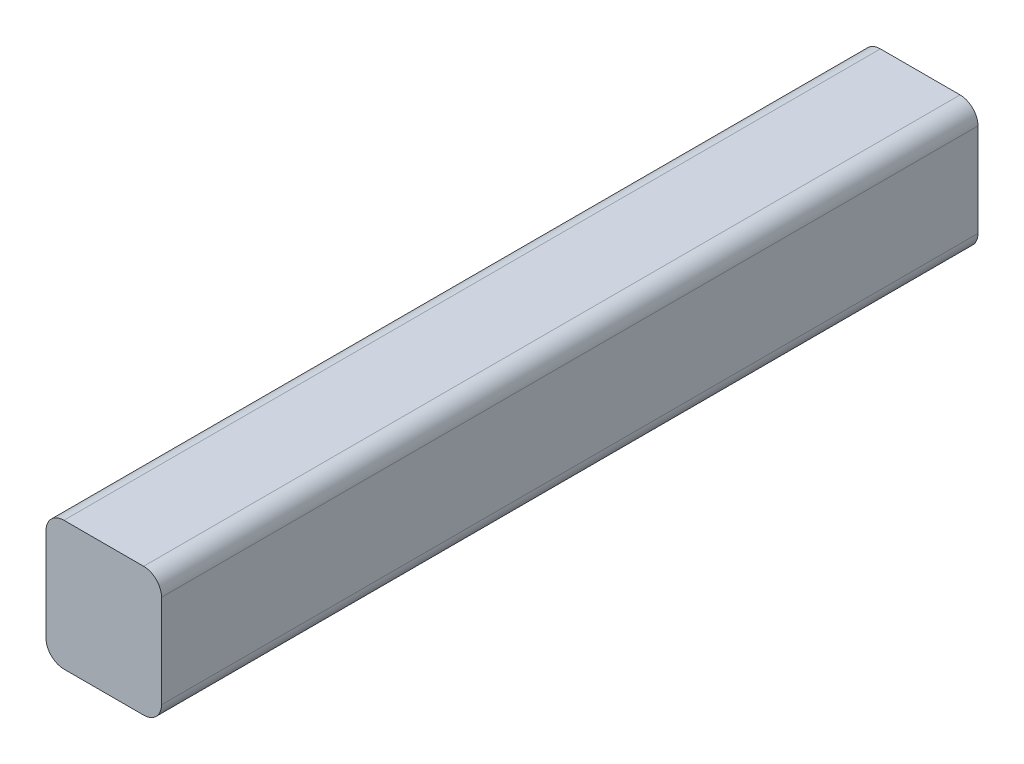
from build123d import *

# Parameters (mm, degrees)
SKETCH1_W           = 32.26
SKETCH1_H           = 36
BOSS_EXTRUDE1_DEPTH = 228
FILLET1_R           = 5


with BuildPart() as part:
    # Sketch1 → Boss-Extrude1 (new body)
    with BuildSketch(Plane.XY):
        with Locations((6.65, 4.78)):
            Rectangle(SKETCH1_W, SKETCH1_H)
    extrude(amount=BOSS_EXTRUDE1_DEPTH)

    # Fillet1
    fillet1_edges = [part.edges().sort_by_distance(p)[0] for p in [
        (22.78, 22.78, 114),
        (22.78, -13.22, 114),
        (-9.48, -13.22, 114),
        (-9.48, 22.78, 114),
    ]]
    fillet(fillet1_edges, radius=FILLET1_R)


solid = part.part
